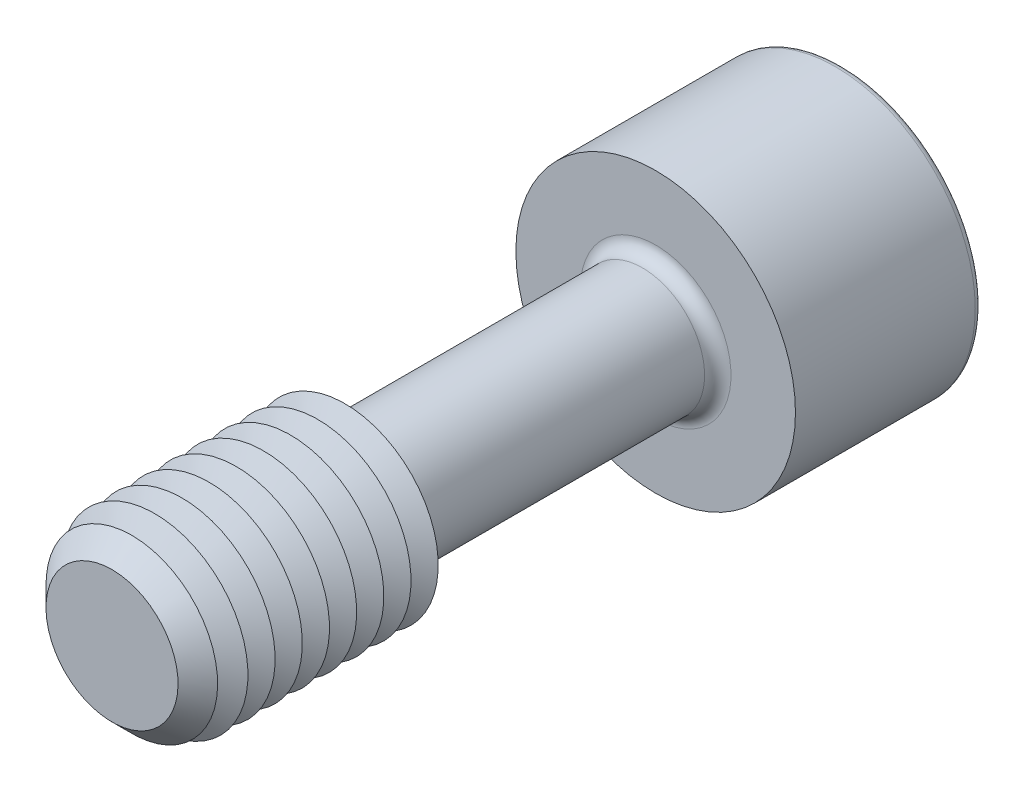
from build123d import *

# Parameters (mm, degrees)
SKETCH1_R       = 4
EXTRUDE1_DEPTH  = 17.5
CHAMFER1_SIZE   = 1.75
SKETCH3_R       = 9
EXTRUDE2_DEPTH  = 12
EXTRUDE3_DEPTH  = 10
FILLET1_R       = 0.85
FILLET2_R       = 0.425
LPATTERN1_COUNT = 8
LPATTERN1_PITCH = 1.75


with BuildPart() as part:
    # Sketch1 → Extrude1 (new, symmetric)
    with BuildSketch(Plane.XY):
        Circle(SKETCH1_R)
    extrude(amount=EXTRUDE1_DEPTH, both=True)

    # Sketch2 → Revolve1 (revolve)
    with BuildSketch(Plane(origin=(0, 0, 0), x_dir=(0, 0, -1), z_dir=(1, 0, 0))):
        Polygon((-17.5, 0), (-17.5, 6), (-2.5, 6), (-1.345299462, 4), (-1.345299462, 0), align=None)
    revolve(axis=Axis((0, 0, 1.345299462), (0, 0, 1)))

    # Chamfer1
    chamfer1_edges = [part.edges().sort_by_distance(p)[0] for p in [
        (0, -6, 17.5),
    ]]
    chamfer(chamfer1_edges, length=CHAMFER1_SIZE)

    # Sketch3 → Extrude2 (add)
    with BuildSketch(Plane(origin=(0, 0, -17.5), x_dir=(-1, 0, 0), z_dir=(0, 0, -1))):
        Circle(SKETCH3_R)
    extrude(amount=EXTRUDE2_DEPTH)

    # Sketch4 → Extrude3 (cut)
    with BuildSketch(Plane(origin=(-13.7, 0, -29.5), x_dir=(1, 0, 0), z_dir=(0, 0, 1))):
        Polygon((10.813248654, -5), (16.586751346, -5), (19.473502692, 0), (16.586751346, 5), (10.813248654, 5), (7.926497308, 0), align=None)
    extrude(amount=EXTRUDE3_DEPTH, mode=Mode.SUBTRACT)

    # Fillet1
    fillet1_edges = [part.edges().sort_by_distance(p)[0] for p in [
        (-4, 0, -17.5),
    ]]
    fillet(fillet1_edges, radius=FILLET1_R)

    # Fillet2
    fillet2_edges = [part.edges().sort_by_distance(p)[0] for p in [
        (9, 0, -29.5),
    ]]
    fillet(fillet2_edges, radius=FILLET2_R)

    # Sketch5 → Cut-Revolve1 (revolve, cut)
    with BuildSketch(Plane(origin=(0, 0, 0), x_dir=(0, 0, -1), z_dir=(1, 0, 0)), mode=Mode.PRIVATE) as cut_revolve1_sk:
        Polygon((19.5, 0), (19.5, -5), (16.613248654, 0), align=None)
    revolve(cut_revolve1_sk.sketch.rotate(Axis((0, 0, -16.613248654), (0, 0, -1)), 90), axis=Axis((0, 0, -16.613248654), (0, 0, -1)), mode=Mode.SUBTRACT)

    # Sketch7 → Cut-Revolve2 (revolve, cut)
    with BuildSketch(Plane(origin=(0, 0, 0), x_dir=(0, 0, -1), z_dir=(1, 0, 0)), mode=Mode.PRIVATE) as cut_revolve2_sk:
        Polygon((-2.5, 6), (-3.375, 4.484455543), (-4.25, 6), align=None)
    cut_revolve2 = revolve(cut_revolve2_sk.sketch.rotate(Axis((0, 0, -1.332048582), (0, 0, 1)), 90), axis=Axis((0, 0, -1.332048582), (0, 0, 1)), mode=Mode.SUBTRACT)

    # LPattern1: Cut-Revolve2 ×8
    with Locations(*[(0, 0, i * LPATTERN1_PITCH) for i in range(1, LPATTERN1_COUNT)]):
        add(cut_revolve2, mode=Mode.SUBTRACT)


solid = part.part
